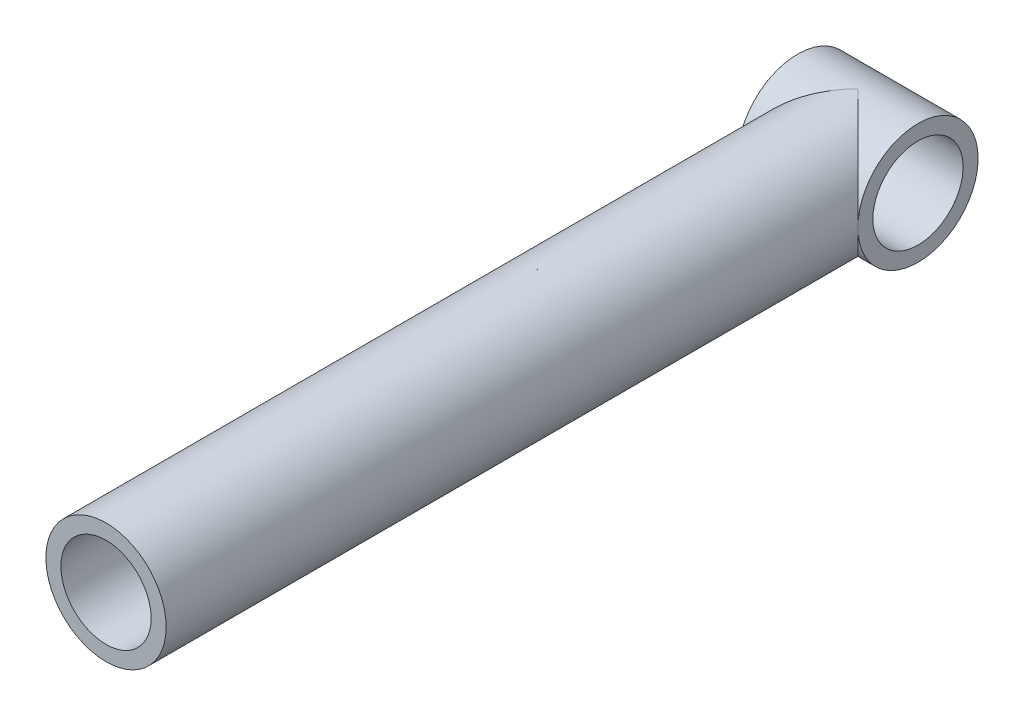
ISO-10303-21;
HEADER;
FILE_DESCRIPTION(('STEP AP214'),'2;1');
FILE_NAME('part.step','',(''),(''),'','','');
FILE_SCHEMA(('AUTOMOTIVE_DESIGN { 1 0 10303 214 1 1 1 1 }'));
ENDSEC;
DATA;
#1=APPLICATION_CONTEXT('core data for automotive mechanical design processes');
#2=APPLICATION_PROTOCOL_DEFINITION('international standard','automotive_design',2000,#1);
#3=PRODUCT_CONTEXT('',#1,'mechanical');
#4=PRODUCT('Part','Part','',(#3));
#5=PRODUCT_RELATED_PRODUCT_CATEGORY('part','',(#4));
#6=PRODUCT_DEFINITION_FORMATION('','',#4);
#7=PRODUCT_DEFINITION_CONTEXT('part definition',#1,'design');
#8=PRODUCT_DEFINITION('design','',#6,#7);
#9=PRODUCT_DEFINITION_SHAPE('','',#8);
#10=(LENGTH_UNIT() NAMED_UNIT(*) SI_UNIT(.MILLI.,.METRE.));
#11=(NAMED_UNIT(*) PLANE_ANGLE_UNIT() SI_UNIT($,.RADIAN.));
#12=(NAMED_UNIT(*) SI_UNIT($,.STERADIAN.) SOLID_ANGLE_UNIT());
#13=UNCERTAINTY_MEASURE_WITH_UNIT(LENGTH_MEASURE(1.E-05),#10,'distance_accuracy_value','');
#14=(GEOMETRIC_REPRESENTATION_CONTEXT(3) GLOBAL_UNCERTAINTY_ASSIGNED_CONTEXT((#13)) GLOBAL_UNIT_ASSIGNED_CONTEXT((#10,
#11,#12)) REPRESENTATION_CONTEXT('',''));
#15=CARTESIAN_POINT('',(0.,0.,0.));
#16=DIRECTION('',(0.,0.,1.));
#17=DIRECTION('',(1.,0.,0.));
#18=AXIS2_PLACEMENT_3D('',#15,#16,#17);
#19=CARTESIAN_POINT('',(20.,0.,0.));
#20=DIRECTION('',(-1.,0.,0.));
#21=DIRECTION('',(0.,0.,1.));
#22=AXIS2_PLACEMENT_3D('',#19,#20,#21);
#23=CYLINDRICAL_SURFACE('',#22,20.);
#24=CARTESIAN_POINT('',(0.,0.,0.));
#25=DIRECTION('',(0.707106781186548,0.,-0.707106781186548));
#26=DIRECTION('',(-0.707106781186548,0.,-0.707106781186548));
#27=AXIS2_PLACEMENT_3D('',#24,#25,#26);
#28=ELLIPSE('',#27,28.2842712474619,20.);
#29=CARTESIAN_POINT('',(20.,0.,20.));
#30=VERTEX_POINT('',#29);
#31=CARTESIAN_POINT('',(0.,-20.,0.));
#32=VERTEX_POINT('',#31);
#33=EDGE_CURVE('E37',#30,#32,#28,.T.);
#34=ORIENTED_EDGE('',*,*,#33,.T.);
#35=CARTESIAN_POINT('',(0.,0.,0.));
#36=DIRECTION('',(-0.707106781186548,0.,-0.707106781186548));
#37=DIRECTION('',(0.707106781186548,0.,-0.707106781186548));
#38=AXIS2_PLACEMENT_3D('',#35,#36,#37);
#39=ELLIPSE('',#38,28.2842712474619,20.);
#40=CARTESIAN_POINT('',(-20.,0.,20.));
#41=VERTEX_POINT('',#40);
#42=EDGE_CURVE('E47',#32,#41,#39,.T.);
#43=ORIENTED_EDGE('',*,*,#42,.T.);
#44=CARTESIAN_POINT('',(-20.,0.,0.));
#45=DIRECTION('',(1.,0.,0.));
#46=DIRECTION('',(0.,0.,-1.));
#47=AXIS2_PLACEMENT_3D('',#44,#45,#46);
#48=CIRCLE('',#47,20.);
#49=EDGE_CURVE('E112',#41,#41,#48,.T.);
#50=ORIENTED_EDGE('',*,*,#49,.T.);
#51=CARTESIAN_POINT('',(0.,20.,0.));
#52=VERTEX_POINT('',#51);
#53=EDGE_CURVE('E42',#41,#52,#39,.T.);
#54=ORIENTED_EDGE('',*,*,#53,.T.);
#55=EDGE_CURVE('E54',#52,#30,#28,.T.);
#56=ORIENTED_EDGE('',*,*,#55,.T.);
#57=CARTESIAN_POINT('',(20.,0.,0.));
#58=DIRECTION('',(1.,0.,0.));
#59=DIRECTION('',(0.,0.,-1.));
#60=AXIS2_PLACEMENT_3D('',#57,#58,#59);
#61=CIRCLE('',#60,20.);
#62=EDGE_CURVE('E53',#30,#30,#61,.T.);
#63=ORIENTED_EDGE('',*,*,#62,.F.);
#64=EDGE_LOOP('',(#34,#43,#50,#54,#56,#63));
#65=FACE_BOUND('',#64,.T.);
#66=ADVANCED_FACE('F17',(#65),#23,.T.);
#67=CARTESIAN_POINT('',(20.,0.,0.));
#68=DIRECTION('',(1.,0.,0.));
#69=DIRECTION('',(0.,0.,-1.));
#70=AXIS2_PLACEMENT_3D('',#67,#68,#69);
#71=PLANE('',#70);
#72=CARTESIAN_POINT('',(20.,0.,0.));
#73=DIRECTION('',(-1.,0.,0.));
#74=DIRECTION('',(0.,0.,1.));
#75=AXIS2_PLACEMENT_3D('',#72,#73,#74);
#76=CIRCLE('',#75,15.);
#77=CARTESIAN_POINT('',(20.,0.,15.));
#78=VERTEX_POINT('',#77);
#79=EDGE_CURVE('E107',#78,#78,#76,.T.);
#80=ORIENTED_EDGE('',*,*,#79,.T.);
#81=EDGE_LOOP('',(#80));
#82=FACE_BOUND('',#81,.T.);
#83=ORIENTED_EDGE('',*,*,#62,.T.);
#84=EDGE_LOOP('',(#83));
#85=FACE_BOUND('',#84,.T.);
#86=ADVANCED_FACE('F80',(#82,#85),#71,.T.);
#87=CARTESIAN_POINT('',(-20.,0.,0.));
#88=DIRECTION('',(1.,0.,0.));
#89=DIRECTION('',(0.,0.,-1.));
#90=AXIS2_PLACEMENT_3D('',#87,#88,#89);
#91=PLANE('',#90);
#92=CARTESIAN_POINT('',(-20.,0.,0.));
#93=DIRECTION('',(-1.,0.,0.));
#94=DIRECTION('',(0.,0.,1.));
#95=AXIS2_PLACEMENT_3D('',#92,#93,#94);
#96=CIRCLE('',#95,15.);
#97=CARTESIAN_POINT('',(-20.,0.,15.));
#98=VERTEX_POINT('',#97);
#99=EDGE_CURVE('E110',#98,#98,#96,.T.);
#100=ORIENTED_EDGE('',*,*,#99,.F.);
#101=EDGE_LOOP('',(#100));
#102=FACE_BOUND('',#101,.T.);
#103=ORIENTED_EDGE('',*,*,#49,.F.);
#104=EDGE_LOOP('',(#103));
#105=FACE_BOUND('',#104,.T.);
#106=ADVANCED_FACE('F73',(#102,#105),#91,.F.);
#107=CARTESIAN_POINT('',(0.,0.,250.));
#108=DIRECTION('',(0.,0.,-1.));
#109=DIRECTION('',(-1.,0.,0.));
#110=AXIS2_PLACEMENT_3D('',#107,#108,#109);
#111=CYLINDRICAL_SURFACE('',#110,20.);
#112=CARTESIAN_POINT('',(0.,0.,250.));
#113=DIRECTION('',(0.,0.,1.));
#114=DIRECTION('',(1.,0.,0.));
#115=AXIS2_PLACEMENT_3D('',#112,#113,#114);
#116=CIRCLE('',#115,20.);
#117=CARTESIAN_POINT('',(20.,0.,250.));
#118=VERTEX_POINT('',#117);
#119=EDGE_CURVE('E11',#118,#118,#116,.T.);
#120=ORIENTED_EDGE('',*,*,#119,.F.);
#121=EDGE_LOOP('',(#120));
#122=FACE_BOUND('',#121,.T.);
#123=ORIENTED_EDGE('',*,*,#42,.F.);
#124=ORIENTED_EDGE('',*,*,#33,.F.);
#125=ORIENTED_EDGE('',*,*,#55,.F.);
#126=ORIENTED_EDGE('',*,*,#53,.F.);
#127=EDGE_LOOP('',(#123,#124,#125,#126));
#128=FACE_BOUND('',#127,.T.);
#129=ADVANCED_FACE('F19',(#122,#128),#111,.T.);
#130=CARTESIAN_POINT('',(0.,0.,250.));
#131=DIRECTION('',(0.,0.,-1.));
#132=DIRECTION('',(-1.,0.,0.));
#133=AXIS2_PLACEMENT_3D('',#130,#131,#132);
#134=CYLINDRICAL_SURFACE('',#133,15.);
#135=CARTESIAN_POINT('',(0.,0.,250.));
#136=DIRECTION('',(0.,0.,1.));
#137=DIRECTION('',(1.,0.,0.));
#138=AXIS2_PLACEMENT_3D('',#135,#136,#137);
#139=CIRCLE('',#138,15.);
#140=CARTESIAN_POINT('',(15.,0.,250.));
#141=VERTEX_POINT('',#140);
#142=EDGE_CURVE('E30',#141,#141,#139,.T.);
#143=ORIENTED_EDGE('',*,*,#142,.T.);
#144=EDGE_LOOP('',(#143));
#145=FACE_BOUND('',#144,.T.);
#146=CARTESIAN_POINT('',(-15.,0.,20.));
#147=CARTESIAN_POINT('',(-14.9999963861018,0.366296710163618,19.9999965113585));
#148=CARTESIAN_POINT('',(-14.98655812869,0.732685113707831,19.9899124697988));
#149=CARTESIAN_POINT('',(-14.9330150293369,1.4625693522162,19.9498028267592));
#150=CARTESIAN_POINT('',(-14.8928942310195,1.82606332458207,19.9197652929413));
#151=CARTESIAN_POINT('',(-14.7865351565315,2.54789047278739,19.8403721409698));
#152=CARTESIAN_POINT('',(-14.720239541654,2.90621051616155,19.7909741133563));
#153=CARTESIAN_POINT('',(-14.562596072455,3.61418352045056,19.6740035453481));
#154=CARTESIAN_POINT('',(-14.4712516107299,3.96383764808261,19.6064334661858));
#155=CARTESIAN_POINT('',(-14.2654563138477,4.65019870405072,19.4550358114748));
#156=CARTESIAN_POINT('',(-14.1511500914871,4.98697169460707,19.3713101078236));
#157=CARTESIAN_POINT('',(-13.9005244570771,5.64804382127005,19.1889861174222));
#158=CARTESIAN_POINT('',(-13.7642043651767,5.97234257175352,19.0903873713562));
#159=CARTESIAN_POINT('',(-13.4711075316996,6.60691757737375,18.8801566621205));
#160=CARTESIAN_POINT('',(-13.3143414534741,6.91720102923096,18.7685314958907));
#161=CARTESIAN_POINT('',(-12.9817062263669,7.52294704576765,18.5340437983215));
#162=CARTESIAN_POINT('',(-12.8058342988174,7.81840744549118,18.4111796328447));
#163=CARTESIAN_POINT('',(-12.4192221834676,8.42035871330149,18.1443031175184));
#164=CARTESIAN_POINT('',(-12.2067615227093,8.72534255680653,17.999385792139));
#165=CARTESIAN_POINT('',(-11.7621319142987,9.3160583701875,17.700864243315));
#166=CARTESIAN_POINT('',(-11.5299619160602,9.60178931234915,17.5472595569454));
#167=CARTESIAN_POINT('',(-11.0468196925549,10.1539423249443,17.2336413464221));
#168=CARTESIAN_POINT('',(-10.7958215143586,10.4203367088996,17.0736191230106));
#169=CARTESIAN_POINT('',(-10.2762707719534,10.9330453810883,16.7499388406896));
#170=CARTESIAN_POINT('',(-10.0077168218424,11.1793580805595,16.5862804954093));
#171=CARTESIAN_POINT('',(-9.3974101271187,11.6995959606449,16.2246453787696));
#172=CARTESIAN_POINT('',(-9.05187565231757,11.9689544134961,16.0264558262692));
#173=CARTESIAN_POINT('',(-8.33702812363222,12.4774364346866,15.6338343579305));
#174=CARTESIAN_POINT('',(-7.96770794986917,12.7165508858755,15.4394035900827));
#175=CARTESIAN_POINT('',(-7.20608110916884,13.1630960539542,15.0604959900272));
#176=CARTESIAN_POINT('',(-6.81379796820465,13.3705584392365,14.8760093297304));
#177=CARTESIAN_POINT('',(-6.00624867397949,13.7522438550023,14.5238817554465));
#178=CARTESIAN_POINT('',(-5.59099577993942,13.9264858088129,14.3562312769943));
#179=CARTESIAN_POINT('',(-4.88479643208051,14.1854714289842,14.0994098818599));
#180=CARTESIAN_POINT('',(-4.60016260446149,14.2803956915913,14.0030661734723));
#181=CARTESIAN_POINT('',(-4.02184719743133,14.4539208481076,13.8238821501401));
#182=CARTESIAN_POINT('',(-3.72816855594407,14.5325269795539,13.7410375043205));
#183=CARTESIAN_POINT('',(-3.13318756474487,14.6722978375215,13.5916939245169));
#184=CARTESIAN_POINT('',(-2.83190065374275,14.7334952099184,13.52516442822));
#185=CARTESIAN_POINT('',(-2.2226379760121,14.8376332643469,13.4108404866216));
#186=CARTESIAN_POINT('',(-1.9146622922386,14.8805741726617,13.3630458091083));
#187=CARTESIAN_POINT('',(-1.29123468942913,14.9476378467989,13.2879911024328));
#188=CARTESIAN_POINT('',(-0.975740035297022,14.9715836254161,13.2609242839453));
#189=CARTESIAN_POINT('',(-0.342730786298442,14.9994296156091,13.2294204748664));
#190=CARTESIAN_POINT('',(-0.0252162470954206,15.0033303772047,13.224982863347));
#191=CARTESIAN_POINT('',(0.609009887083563,14.990988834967,13.2389702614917));
#192=CARTESIAN_POINT('',(0.925721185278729,14.9747399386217,13.2574027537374));
#193=CARTESIAN_POINT('',(1.5554283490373,14.9224822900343,13.3161951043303));
#194=CARTESIAN_POINT('',(1.86842417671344,14.8864733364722,13.3565551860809));
#195=CARTESIAN_POINT('',(2.4550253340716,14.8003740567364,13.451860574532));
#196=CARTESIAN_POINT('',(2.72925137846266,14.7522110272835,13.5047743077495));
#197=CARTESIAN_POINT('',(3.27166976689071,14.6414778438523,13.6247493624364));
#198=CARTESIAN_POINT('',(3.5398599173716,14.5789025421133,13.6918157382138));
#199=CARTESIAN_POINT('',(4.33419345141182,14.3706061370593,13.9113732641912));
#200=CARTESIAN_POINT('',(4.85004827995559,14.2043223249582,14.08221377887));
#201=CARTESIAN_POINT('',(5.75640752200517,13.8583376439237,14.4219895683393));
#202=CARTESIAN_POINT('',(6.15233722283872,13.6869339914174,14.585328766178));
#203=CARTESIAN_POINT('',(6.92314358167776,13.3136549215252,14.9268415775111));
#204=CARTESIAN_POINT('',(7.29800930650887,13.1117638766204,15.1050227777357));
#205=CARTESIAN_POINT('',(8.02693261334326,12.6786637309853,15.4703569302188));
#206=CARTESIAN_POINT('',(8.38094538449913,12.447394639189,15.6575277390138));
#207=CARTESIAN_POINT('',(9.0670044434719,11.9568887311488,16.0352309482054));
#208=CARTESIAN_POINT('',(9.39905416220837,11.6976562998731,16.2257628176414));
#209=CARTESIAN_POINT('',(10.0487102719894,11.1449480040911,16.6104291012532));
#210=CARTESIAN_POINT('',(10.3657402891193,10.8507727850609,16.804533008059));
#211=CARTESIAN_POINT('',(10.9749424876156,10.2341805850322,17.1870062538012));
#212=CARTESIAN_POINT('',(11.2671121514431,9.91176075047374,17.3753750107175));
#213=CARTESIAN_POINT('',(11.8243371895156,9.23987019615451,17.7417864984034));
#214=CARTESIAN_POINT('',(12.08943761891,8.89044618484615,17.9198461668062));
#215=CARTESIAN_POINT('',(12.5907609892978,8.16498687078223,18.2618094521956));
#216=CARTESIAN_POINT('',(12.8269913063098,7.78895840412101,18.4257166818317));
#217=CARTESIAN_POINT('',(13.2236212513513,7.0896706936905,18.7042362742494));
#218=CARTESIAN_POINT('',(13.3897279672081,6.77094997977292,18.8221427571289));
#219=CARTESIAN_POINT('',(13.7001617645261,6.11849819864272,19.0442292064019));
#220=CARTESIAN_POINT('',(13.8444933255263,5.78477023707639,19.1484119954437));
#221=CARTESIAN_POINT('',(14.1097181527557,5.10385045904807,19.3410403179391));
#222=CARTESIAN_POINT('',(14.2306201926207,4.7566637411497,19.4294917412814));
#223=CARTESIAN_POINT('',(14.4474519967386,4.05061594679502,19.5888606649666));
#224=CARTESIAN_POINT('',(14.543381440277,3.69175472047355,19.6597779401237));
#225=CARTESIAN_POINT('',(14.7093306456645,2.96248007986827,19.7828533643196));
#226=CARTESIAN_POINT('',(14.779184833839,2.59200851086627,19.8348915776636));
#227=CARTESIAN_POINT('',(14.8909502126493,1.84455393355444,19.9183084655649));
#228=CARTESIAN_POINT('',(14.932861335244,1.46757090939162,19.9496870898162));
#229=CARTESIAN_POINT('',(14.9879704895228,0.710460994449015,19.9909711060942));
#230=CARTESIAN_POINT('',(15.0011780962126,0.330335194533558,20.0008836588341));
#231=CARTESIAN_POINT('',(14.9986571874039,-0.429748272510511,19.9989928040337));
#232=CARTESIAN_POINT('',(14.9829309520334,-0.809705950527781,19.9871911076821));
#233=CARTESIAN_POINT('',(14.9258791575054,-1.52792655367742,19.9444619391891));
#234=CARTESIAN_POINT('',(14.8872913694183,-1.86653464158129,19.9155804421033));
#235=CARTESIAN_POINT('',(14.7875385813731,-2.53851557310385,19.8411238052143));
#236=CARTESIAN_POINT('',(14.7263753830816,-2.87188883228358,19.7955499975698));
#237=CARTESIAN_POINT('',(14.5823024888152,-3.53134483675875,19.6886063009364));
#238=CARTESIAN_POINT('',(14.4993898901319,-3.85742660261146,19.6272343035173));
#239=CARTESIAN_POINT('',(14.3128639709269,-4.50044558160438,19.4898460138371));
#240=CARTESIAN_POINT('',(14.2092496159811,-4.81738233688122,19.4138289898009));
#241=CARTESIAN_POINT('',(13.9784956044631,-5.45155899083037,19.2455679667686));
#242=CARTESIAN_POINT('',(13.8506564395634,-5.76841713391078,19.1528471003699));
#243=CARTESIAN_POINT('',(13.5753911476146,-6.38937517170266,18.95473857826));
#244=CARTESIAN_POINT('',(13.4279647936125,-6.69347491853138,18.8493507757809));
#245=CARTESIAN_POINT('',(13.1148514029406,-7.28790228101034,18.6275900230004));
#246=CARTESIAN_POINT('',(12.9491654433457,-7.57823070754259,18.511217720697));
#247=CARTESIAN_POINT('',(12.6007388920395,-8.14444045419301,18.2691793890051));
#248=CARTESIAN_POINT('',(12.4179958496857,-8.42031968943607,18.143512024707));
#249=CARTESIAN_POINT('',(12.0047157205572,-9.00191272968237,17.8629913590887));
#250=CARTESIAN_POINT('',(11.7712929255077,-9.30491784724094,17.706768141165));
#251=CARTESIAN_POINT('',(11.2842239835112,-9.88995490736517,17.3867762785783));
#252=CARTESIAN_POINT('',(11.0305758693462,-10.1719848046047,17.2230069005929));
#253=CARTESIAN_POINT('',(10.503681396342,-10.7152305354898,16.8903956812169));
#254=CARTESIAN_POINT('',(10.2303950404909,-10.9764014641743,16.7215439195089));
#255=CARTESIAN_POINT('',(9.66554891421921,-11.4769148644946,16.3820599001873));
#256=CARTESIAN_POINT('',(9.37398804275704,-11.7162560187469,16.2114275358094));
#257=CARTESIAN_POINT('',(8.71597382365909,-12.2161163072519,15.8392270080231));
#258=CARTESIAN_POINT('',(8.34582292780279,-12.4720060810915,15.6379471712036));
#259=CARTESIAN_POINT('',(7.58075412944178,-12.9512931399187,15.2433717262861));
#260=CARTESIAN_POINT('',(7.18582720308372,-13.1746784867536,15.0500790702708));
#261=CARTESIAN_POINT('',(6.37252076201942,-13.5866966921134,14.6791792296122));
#262=CARTESIAN_POINT('',(5.95419948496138,-13.7754112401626,14.5015357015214));
#263=CARTESIAN_POINT('',(5.09393731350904,-14.1161407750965,14.1700761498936));
#264=CARTESIAN_POINT('',(4.65201637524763,-14.2681861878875,14.0162404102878));
#265=CARTESIAN_POINT('',(3.9225267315,-14.4809148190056,13.7955307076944));
#266=CARTESIAN_POINT('',(3.64175705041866,-14.554134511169,13.7181020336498));
#267=CARTESIAN_POINT('',(3.07294660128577,-14.6847566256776,13.5781842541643));
#268=CARTESIAN_POINT('',(2.78490843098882,-14.7421646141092,13.515689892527));
#269=CARTESIAN_POINT('',(2.20334570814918,-14.8402173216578,13.4079554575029));
#270=CARTESIAN_POINT('',(1.90983235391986,-14.8808930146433,13.3626835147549));
#271=CARTESIAN_POINT('',(1.31859557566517,-14.9448886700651,13.2910731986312));
#272=CARTESIAN_POINT('',(1.02087214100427,-14.9682085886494,13.2647348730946));
#273=CARTESIAN_POINT('',(0.421908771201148,-14.9970777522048,13.2320878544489));
#274=CARTESIAN_POINT('',(0.120658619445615,-15.0025347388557,13.2258831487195));
#275=CARTESIAN_POINT('',(-0.481330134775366,-14.9952971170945,13.2340882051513));
#276=CARTESIAN_POINT('',(-0.782068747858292,-14.9826028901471,13.2484975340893));
#277=CARTESIAN_POINT('',(-1.38093930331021,-14.9393187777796,13.2972856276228));
#278=CARTESIAN_POINT('',(-1.6790679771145,-14.9087090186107,13.3316865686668));
#279=CARTESIAN_POINT('',(-2.27028883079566,-14.8301978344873,13.4189661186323));
#280=CARTESIAN_POINT('',(-2.56338030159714,-14.7822939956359,13.471847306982));
#281=CARTESIAN_POINT('',(-3.2061262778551,-14.6577625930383,13.6073586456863));
#282=CARTESIAN_POINT('',(-3.55417107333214,-14.5771485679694,13.6939620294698));
#283=CARTESIAN_POINT('',(-4.23840886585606,-14.3931068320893,13.8872689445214));
#284=CARTESIAN_POINT('',(-4.57459886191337,-14.2896733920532,13.9939775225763));
#285=CARTESIAN_POINT('',(-5.23472950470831,-14.0612891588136,14.2234447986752));
#286=CARTESIAN_POINT('',(-5.55864334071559,-13.9362942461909,14.3462362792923));
#287=CARTESIAN_POINT('',(-6.19301225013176,-13.6662163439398,14.6037448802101));
#288=CARTESIAN_POINT('',(-6.50346651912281,-13.5211321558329,14.7384627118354));
#289=CARTESIAN_POINT('',(-7.21617121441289,-13.1581772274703,15.0645505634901));
#290=CARTESIAN_POINT('',(-7.6128979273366,-12.9325179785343,15.259358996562));
#291=CARTESIAN_POINT('',(-8.38146877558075,-12.4481879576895,15.6569759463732));
#292=CARTESIAN_POINT('',(-8.75330510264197,-12.1895068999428,15.8597869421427));
#293=CARTESIAN_POINT('',(-9.47179963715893,-11.6400033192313,16.2673735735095));
#294=CARTESIAN_POINT('',(-9.8184386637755,-11.3491567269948,16.4721505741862));
#295=CARTESIAN_POINT('',(-10.4851578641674,-10.7362223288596,16.8780523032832));
#296=CARTESIAN_POINT('',(-10.8052412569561,-10.4141383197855,17.0791774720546));
#297=CARTESIAN_POINT('',(-11.4198131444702,-9.73646889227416,17.4744480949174));
#298=CARTESIAN_POINT('',(-11.7140638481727,-9.38062459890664,17.6685206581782));
#299=CARTESIAN_POINT('',(-12.2715599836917,-8.63852769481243,18.0429641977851));
#300=CARTESIAN_POINT('',(-12.5348013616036,-8.25227111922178,18.223333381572));
#301=CARTESIAN_POINT('',(-13.0267063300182,-7.45152859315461,18.5651250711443));
#302=CARTESIAN_POINT('',(-13.2554354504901,-7.03709836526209,18.7265833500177));
#303=CARTESIAN_POINT('',(-13.6752961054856,-6.18166474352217,19.0260894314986));
#304=CARTESIAN_POINT('',(-13.8664470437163,-5.74067521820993,19.1641493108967));
#305=CARTESIAN_POINT('',(-14.1574408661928,-4.96827991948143,19.3759218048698));
#306=CARTESIAN_POINT('',(-14.2676240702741,-4.64264489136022,19.4566336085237));
#307=CARTESIAN_POINT('',(-14.4660965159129,-3.98135077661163,19.6026380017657));
#308=CARTESIAN_POINT('',(-14.5543867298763,-3.64569213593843,19.6679312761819));
#309=CARTESIAN_POINT('',(-14.707704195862,-2.96717677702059,19.7816563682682));
#310=CARTESIAN_POINT('',(-14.7727874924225,-2.62433954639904,19.830128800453));
#311=CARTESIAN_POINT('',(-14.879023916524,-1.93308080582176,19.9093971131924));
#312=CARTESIAN_POINT('',(-14.9201892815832,-1.58466224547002,19.9402020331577));
#313=CARTESIAN_POINT('',(-14.9660336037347,-1.02967181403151,19.9745350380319));
#314=CARTESIAN_POINT('',(-14.9787623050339,-0.824089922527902,19.9840758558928));
#315=CARTESIAN_POINT('',(-14.9957472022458,-0.412348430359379,19.9968098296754));
#316=CARTESIAN_POINT('',(-15.0000020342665,-0.206188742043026,20.0000019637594));
#317=CARTESIAN_POINT('',(-15.,0.,20.));
#318=B_SPLINE_CURVE_WITH_KNOTS('',3,(#146,#147,#148,#149,#150,#151,#152,#153,#154,#155,#156,
#157,#158,#159,#160,#161,#162,#163,#164,#165,#166,#167,#168,#169,#170,#171,#172,#173,#174,#175,
#176,#177,#178,#179,#180,#181,#182,#183,#184,#185,#186,#187,#188,#189,#190,#191,#192,#193,#194,
#195,#196,#197,#198,#199,#200,#201,#202,#203,#204,#205,#206,#207,#208,#209,#210,#211,#212,#213,
#214,#215,#216,#217,#218,#219,#220,#221,#222,#223,#224,#225,#226,#227,#228,#229,#230,#231,#232,
#233,#234,#235,#236,#237,#238,#239,#240,#241,#242,#243,#244,#245,#246,#247,#248,#249,#250,#251,
#252,#253,#254,#255,#256,#257,#258,#259,#260,#261,#262,#263,#264,#265,#266,#267,#268,#269,#270,
#271,#272,#273,#274,#275,#276,#277,#278,#279,#280,#281,#282,#283,#284,#285,#286,#287,#288,#289,
#290,#291,#292,#293,#294,#295,#296,#297,#298,#299,#300,#301,#302,#303,#304,#305,#306,#307,#308,
#309,#310,#311,#312,#313,#314,#315,#316,#317),.UNSPECIFIED.,.T.,.F.,(4,2,2,2,2,2,2,2,2,2,2,2,2,
2,2,2,2,2,2,2,2,2,2,2,2,2,2,2,2,2,2,2,2,2,2,2,2,2,2,2,2,2,2,2,2,2,2,2,2,2,2,2,2,2,2,2,2,2,2,2,2,
2,2,2,2,2,2,2,2,2,2,2,2,2,2,2,2,2,2,2,2,2,2,2,2,4),(0.,1.09866762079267,2.19799284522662,
3.29973973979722,4.40133748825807,5.4962034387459,6.59110320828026,7.68543421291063,
8.77992458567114,9.9756380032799,11.1714151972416,12.3688720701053,13.5664235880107,
15.0074376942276,16.4488851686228,17.8888808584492,19.3280538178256,20.2727344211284,
21.217111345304,22.1597054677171,23.1022879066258,24.0535529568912,25.0047919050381,
25.9563421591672,26.9079021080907,27.757281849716,28.6069654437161,30.3064901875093,
31.6888011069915,33.0718230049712,34.457715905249,35.8433917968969,37.2640550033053,
38.6848619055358,40.1032640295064,41.5213030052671,42.6549915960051,43.78844664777,
44.9214764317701,46.0545207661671,47.1946420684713,48.3347661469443,49.4745098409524,
50.6141637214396,51.6390367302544,52.6638279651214,53.6887560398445,54.713735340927,
55.7747812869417,56.8358395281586,57.8968352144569,58.9579835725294,60.1962937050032,
61.4347244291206,62.6757531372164,63.916856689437,65.3940003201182,66.8716851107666,
68.3458423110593,69.8187721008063,70.7189645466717,71.6188396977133,72.5170414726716,
73.4152455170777,74.3180813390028,75.2208981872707,76.1247184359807,77.0286648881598,
78.1298184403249,79.2312487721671,80.3349601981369,81.4387374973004,82.9254852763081,
84.4126972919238,85.9010298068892,87.3891816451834,88.889843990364,90.3907023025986,
91.8886740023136,93.3858701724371,94.4441839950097,95.5024508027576,96.5581443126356,
97.6132972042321,98.2316386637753,98.8500796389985),.UNSPECIFIED.);
#319=CARTESIAN_POINT('',(-15.,0.,20.));
#320=VERTEX_POINT('',#319);
#321=EDGE_CURVE('E21',#320,#320,#318,.T.);
#322=ORIENTED_EDGE('',*,*,#321,.T.);
#323=EDGE_LOOP('',(#322));
#324=FACE_BOUND('',#323,.T.);
#325=ADVANCED_FACE('F63',(#145,#324),#134,.F.);
#326=CARTESIAN_POINT('',(0.,0.,250.));
#327=DIRECTION('',(0.,0.,1.));
#328=DIRECTION('',(1.,0.,0.));
#329=AXIS2_PLACEMENT_3D('',#326,#327,#328);
#330=PLANE('',#329);
#331=ORIENTED_EDGE('',*,*,#142,.F.);
#332=EDGE_LOOP('',(#331));
#333=FACE_BOUND('',#332,.T.);
#334=ORIENTED_EDGE('',*,*,#119,.T.);
#335=EDGE_LOOP('',(#334));
#336=FACE_BOUND('',#335,.T.);
#337=ADVANCED_FACE('F66',(#333,#336),#330,.T.);
#338=ORIENTED_EDGE('',*,*,#321,.F.);
#339=EDGE_LOOP('',(#338));
#340=FACE_BOUND('',#339,.T.);
#341=ADVANCED_FACE('F69',(#340),#23,.T.);
#342=CARTESIAN_POINT('',(20.,0.,0.));
#343=DIRECTION('',(-1.,0.,0.));
#344=DIRECTION('',(0.,0.,1.));
#345=AXIS2_PLACEMENT_3D('',#342,#343,#344);
#346=CYLINDRICAL_SURFACE('',#345,15.);
#347=ORIENTED_EDGE('',*,*,#79,.F.);
#348=EDGE_LOOP('',(#347));
#349=FACE_BOUND('',#348,.T.);
#350=ORIENTED_EDGE('',*,*,#99,.T.);
#351=EDGE_LOOP('',(#350));
#352=FACE_BOUND('',#351,.T.);
#353=ADVANCED_FACE('F92',(#349,#352),#346,.F.);
#354=CLOSED_SHELL('',(#66,#86,#106,#129,#325,#337,#341,#353));
#355=MANIFOLD_SOLID_BREP('B1',#354);
#356=ADVANCED_BREP_SHAPE_REPRESENTATION('',(#18,#355),#14);
#357=SHAPE_DEFINITION_REPRESENTATION(#9,#356);
ENDSEC;
END-ISO-10303-21;
